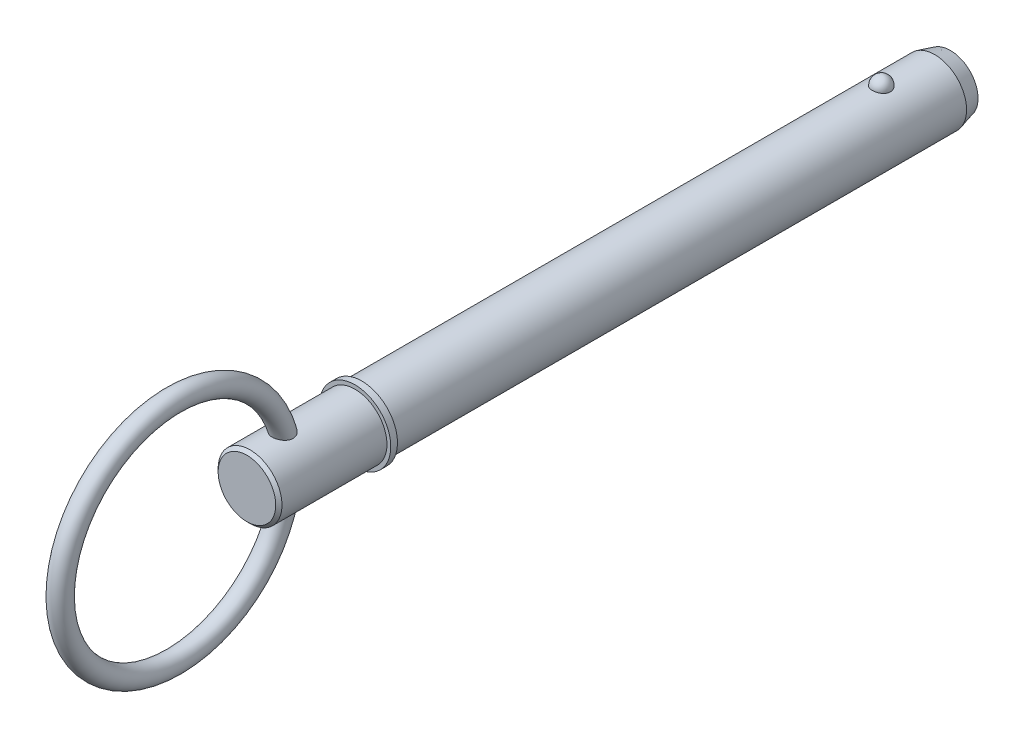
ISO-10303-21;
HEADER;
FILE_DESCRIPTION(('STEP AP214'),'2;1');
FILE_NAME('part.step','',(''),(''),'','','');
FILE_SCHEMA(('AUTOMOTIVE_DESIGN { 1 0 10303 214 1 1 1 1 }'));
ENDSEC;
DATA;
#1=APPLICATION_CONTEXT('core data for automotive mechanical design processes');
#2=APPLICATION_PROTOCOL_DEFINITION('international standard','automotive_design',2000,#1);
#3=PRODUCT_CONTEXT('',#1,'mechanical');
#4=PRODUCT('Part','Part','',(#3));
#5=PRODUCT_RELATED_PRODUCT_CATEGORY('part','',(#4));
#6=PRODUCT_DEFINITION_FORMATION('','',#4);
#7=PRODUCT_DEFINITION_CONTEXT('part definition',#1,'design');
#8=PRODUCT_DEFINITION('design','',#6,#7);
#9=PRODUCT_DEFINITION_SHAPE('','',#8);
#10=(LENGTH_UNIT() NAMED_UNIT(*) SI_UNIT(.MILLI.,.METRE.));
#11=(NAMED_UNIT(*) PLANE_ANGLE_UNIT() SI_UNIT($,.RADIAN.));
#12=(NAMED_UNIT(*) SI_UNIT($,.STERADIAN.) SOLID_ANGLE_UNIT());
#13=UNCERTAINTY_MEASURE_WITH_UNIT(LENGTH_MEASURE(1.E-05),#10,'distance_accuracy_value','');
#14=(GEOMETRIC_REPRESENTATION_CONTEXT(3) GLOBAL_UNCERTAINTY_ASSIGNED_CONTEXT((#13)) GLOBAL_UNIT_ASSIGNED_CONTEXT((#10,
#11,#12)) REPRESENTATION_CONTEXT('',''));
#15=CARTESIAN_POINT('',(0.,0.,0.));
#16=DIRECTION('',(0.,0.,1.));
#17=DIRECTION('',(1.,0.,0.));
#18=AXIS2_PLACEMENT_3D('',#15,#16,#17);
#19=CARTESIAN_POINT('',(0.,0.,114.3));
#20=DIRECTION('',(0.,0.,-1.));
#21=DIRECTION('',(-1.,0.,0.));
#22=AXIS2_PLACEMENT_3D('',#19,#20,#21);
#23=CYLINDRICAL_SURFACE('',#22,7.145);
#24=CARTESIAN_POINT('',(1.99971637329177,6.85945766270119,-2.02));
#25=CARTESIAN_POINT('',(1.9997145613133,6.85945924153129,-1.9070973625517));
#26=CARTESIAN_POINT('',(1.99051486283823,6.86216053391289,-1.79417185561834));
#27=CARTESIAN_POINT('',(1.95393597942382,6.87266409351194,-1.57152267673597));
#28=CARTESIAN_POINT('',(1.92655029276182,6.88046818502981,-1.46180016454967));
#29=CARTESIAN_POINT('',(1.85429435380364,6.90029063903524,-1.24873107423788));
#30=CARTESIAN_POINT('',(1.80943177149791,6.91230715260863,-1.14538172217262));
#31=CARTESIAN_POINT('',(1.70333474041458,6.93921158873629,-0.947875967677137));
#32=CARTESIAN_POINT('',(1.64210059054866,6.95409945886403,-0.853719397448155));
#33=CARTESIAN_POINT('',(1.5044381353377,6.98517577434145,-0.676721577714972));
#34=CARTESIAN_POINT('',(1.42793505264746,7.00137037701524,-0.593939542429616));
#35=CARTESIAN_POINT('',(1.26189697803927,7.03319066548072,-0.442536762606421));
#36=CARTESIAN_POINT('',(1.17236198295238,7.04881635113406,-0.373916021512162));
#37=CARTESIAN_POINT('',(0.982932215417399,7.0777121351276,-0.252935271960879));
#38=CARTESIAN_POINT('',(0.883068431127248,7.09098897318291,-0.200528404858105));
#39=CARTESIAN_POINT('',(0.675560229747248,7.11375589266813,-0.113212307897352));
#40=CARTESIAN_POINT('',(0.567916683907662,7.12324639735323,-0.0783011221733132));
#41=CARTESIAN_POINT('',(0.350006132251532,7.13724173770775,-0.0274707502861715));
#42=CARTESIAN_POINT('',(0.239822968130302,7.14183447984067,-0.0112162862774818));
#43=CARTESIAN_POINT('',(0.0181946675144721,7.14583597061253,0.00296794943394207));
#44=CARTESIAN_POINT('',(-0.0932503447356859,7.14524522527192,0.000899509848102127));
#45=CARTESIAN_POINT('',(-0.312527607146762,7.13899247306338,-0.0213331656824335));
#46=CARTESIAN_POINT('',(-0.420388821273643,7.13340426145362,-0.0412340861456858));
#47=CARTESIAN_POINT('',(-0.631141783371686,7.11785474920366,-0.0982040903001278));
#48=CARTESIAN_POINT('',(-0.734033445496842,7.10789337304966,-0.135273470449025));
#49=CARTESIAN_POINT('',(-0.932634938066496,7.08458058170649,-0.225826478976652));
#50=CARTESIAN_POINT('',(-1.02829911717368,7.07120963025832,-0.27940508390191));
#51=CARTESIAN_POINT('',(-1.20927180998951,7.04252043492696,-0.401457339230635));
#52=CARTESIAN_POINT('',(-1.29457925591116,7.02720199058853,-0.469932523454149));
#53=CARTESIAN_POINT('',(-1.45423311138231,6.995926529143,-0.621438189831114));
#54=CARTESIAN_POINT('',(-1.5283348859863,6.97996288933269,-0.7047251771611));
#55=CARTESIAN_POINT('',(-1.66169281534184,6.94942414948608,-0.882667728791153));
#56=CARTESIAN_POINT('',(-1.72094789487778,6.93484915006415,-0.977324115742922));
#57=CARTESIAN_POINT('',(-1.82375276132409,6.90853186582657,-1.17661373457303));
#58=CARTESIAN_POINT('',(-1.86711024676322,6.8968248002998,-1.28135093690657));
#59=CARTESIAN_POINT('',(-1.9360425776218,6.87779420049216,-1.49689986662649));
#60=CARTESIAN_POINT('',(-1.96161794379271,6.87047053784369,-1.60771141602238));
#61=CARTESIAN_POINT('',(-1.99427437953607,6.86106309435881,-1.83176258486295));
#62=CARTESIAN_POINT('',(-2.00143373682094,6.8589571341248,-1.9449898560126));
#63=CARTESIAN_POINT('',(-1.99730449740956,6.86016064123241,-2.17107603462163));
#64=CARTESIAN_POINT('',(-1.98601641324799,6.86346995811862,-2.28393495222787));
#65=CARTESIAN_POINT('',(-1.94538181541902,6.87509649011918,-2.5054843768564));
#66=CARTESIAN_POINT('',(-1.91612773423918,6.88338806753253,-2.61419321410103));
#67=CARTESIAN_POINT('',(-1.84036449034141,6.90402888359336,-2.82501243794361));
#68=CARTESIAN_POINT('',(-1.79385462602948,6.91637828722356,-2.92712255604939));
#69=CARTESIAN_POINT('',(-1.68442067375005,6.94384180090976,-3.12247704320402));
#70=CARTESIAN_POINT('',(-1.62140729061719,6.95897081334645,-3.21566929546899));
#71=CARTESIAN_POINT('',(-1.4806650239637,6.99026742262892,-3.38999412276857));
#72=CARTESIAN_POINT('',(-1.40293556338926,7.00643506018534,-3.47112622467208));
#73=CARTESIAN_POINT('',(-1.2344320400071,7.03807960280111,-3.61938672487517));
#74=CARTESIAN_POINT('',(-1.1436092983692,7.05355363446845,-3.68646046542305));
#75=CARTESIAN_POINT('',(-0.9515914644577,7.08201263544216,-3.80431973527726));
#76=CARTESIAN_POINT('',(-0.850397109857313,7.09499778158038,-3.85510642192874));
#77=CARTESIAN_POINT('',(-0.641823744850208,7.11687679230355,-3.93839532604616));
#78=CARTESIAN_POINT('',(-0.534539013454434,7.1258202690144,-3.9711204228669));
#79=CARTESIAN_POINT('',(-0.315743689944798,7.1388605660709,-4.01830716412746));
#80=CARTESIAN_POINT('',(-0.204233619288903,7.14295798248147,-4.03277105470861));
#81=CARTESIAN_POINT('',(0.0175518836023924,7.14582273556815,-4.04291389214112));
#82=CARTESIAN_POINT('',(0.127809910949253,7.14469090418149,-4.03894819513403));
#83=CARTESIAN_POINT('',(0.346044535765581,7.13745046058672,-4.01315850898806));
#84=CARTESIAN_POINT('',(0.454021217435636,7.13134203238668,-3.99133518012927));
#85=CARTESIAN_POINT('',(0.664227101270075,7.11483713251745,-3.93057164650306));
#86=CARTESIAN_POINT('',(0.766477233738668,7.10445761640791,-3.89169908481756));
#87=CARTESIAN_POINT('',(0.962929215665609,7.08050813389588,-3.79792023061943));
#88=CARTESIAN_POINT('',(1.05713054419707,7.06693796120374,-3.7430129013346));
#89=CARTESIAN_POINT('',(1.23644031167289,7.03780007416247,-3.61765173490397));
#90=CARTESIAN_POINT('',(1.32138387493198,7.0222044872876,-3.54696861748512));
#91=CARTESIAN_POINT('',(1.47830582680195,6.99085504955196,-3.39245228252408));
#92=CARTESIAN_POINT('',(1.55028198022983,6.97510117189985,-3.30861680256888));
#93=CARTESIAN_POINT('',(1.68063701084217,6.94485803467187,-3.12843058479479));
#94=CARTESIAN_POINT('',(1.73875175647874,6.93039619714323,-3.03188405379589));
#95=CARTESIAN_POINT('',(1.83823393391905,6.90467783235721,-2.83015210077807));
#96=CARTESIAN_POINT('',(1.87960712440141,6.89342020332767,-2.72496966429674));
#97=CARTESIAN_POINT('',(1.94111647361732,6.87633596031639,-2.52050234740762));
#98=CARTESIAN_POINT('',(1.96305249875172,6.87005682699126,-2.42179225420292));
#99=CARTESIAN_POINT('',(1.99235308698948,6.86161702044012,-2.22206084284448));
#100=CARTESIAN_POINT('',(1.99971799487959,6.85945624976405,-2.12103957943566));
#101=CARTESIAN_POINT('',(1.99971637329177,6.85945766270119,-2.02));
#102=B_SPLINE_CURVE_WITH_KNOTS('',3,(#24,#25,#26,#27,#28,#29,#30,#31,#32,#33,#34,#35,#36,#37,
#38,#39,#40,#41,#42,#43,#44,#45,#46,#47,#48,#49,#50,#51,#52,#53,#54,#55,#56,#57,#58,#59,#60,#61,
#62,#63,#64,#65,#66,#67,#68,#69,#70,#71,#72,#73,#74,#75,#76,#77,#78,#79,#80,#81,#82,#83,#84,#85,
#86,#87,#88,#89,#90,#91,#92,#93,#94,#95,#96,#97,#98,#99,#100,#101),.UNSPECIFIED.,.T.,.F.,(4,2,2,
2,2,2,2,2,2,2,2,2,2,2,2,2,2,2,2,2,2,2,2,2,2,2,2,2,2,2,2,2,2,2,2,2,2,2,4),(0.,0.338345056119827,
0.676811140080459,1.01512885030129,1.35344038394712,1.69345130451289,2.03346230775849,
2.37248128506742,2.71146235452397,3.04425125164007,3.37700766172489,3.70493009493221,
4.03285819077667,4.36270921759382,4.69259422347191,5.02887632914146,5.36518278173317,
5.70543263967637,6.04567253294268,6.38446363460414,6.72324532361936,7.06029846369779,
7.39736530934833,7.73629500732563,8.07523799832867,8.41547528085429,8.7556883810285,
9.09160363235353,9.42747756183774,9.75690239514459,10.0863150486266,10.4144324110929,
10.7425709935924,11.0758313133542,11.4091490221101,11.748385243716,12.0875046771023,
12.3903058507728,12.6930998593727),.UNSPECIFIED.);
#103=CARTESIAN_POINT('',(1.99971637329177,6.85945766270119,-2.02));
#104=VERTEX_POINT('',#103);
#105=EDGE_CURVE('E103',#104,#104,#102,.T.);
#106=ORIENTED_EDGE('',*,*,#105,.T.);
#107=EDGE_LOOP('',(#106));
#108=FACE_BOUND('',#107,.T.);
#109=CARTESIAN_POINT('',(0.,0.,-13.9499999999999));
#110=DIRECTION('',(0.,0.,-1.));
#111=DIRECTION('',(-1.,0.,0.));
#112=AXIS2_PLACEMENT_3D('',#109,#110,#111);
#113=CIRCLE('',#112,7.145);
#114=CARTESIAN_POINT('',(-7.145,0.,-13.9499999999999));
#115=VERTEX_POINT('',#114);
#116=EDGE_CURVE('E110',#115,#115,#113,.F.);
#117=ORIENTED_EDGE('',*,*,#116,.T.);
#118=EDGE_LOOP('',(#117));
#119=FACE_BOUND('',#118,.T.);
#120=CARTESIAN_POINT('',(0.,0.,114.3));
#121=DIRECTION('',(0.,0.,1.));
#122=DIRECTION('',(1.,0.,0.));
#123=AXIS2_PLACEMENT_3D('',#120,#121,#122);
#124=CIRCLE('',#123,7.145);
#125=CARTESIAN_POINT('',(7.145,0.,114.3));
#126=VERTEX_POINT('',#125);
#127=EDGE_CURVE('E108',#126,#126,#124,.T.);
#128=ORIENTED_EDGE('',*,*,#127,.F.);
#129=EDGE_LOOP('',(#128));
#130=FACE_BOUND('',#129,.T.);
#131=ADVANCED_FACE('F39',(#108,#119,#130),#23,.T.);
#132=CARTESIAN_POINT('',(0.,0.,-17.45));
#133=DIRECTION('',(0.,0.,-1.));
#134=DIRECTION('',(-1.,0.,0.));
#135=AXIS2_PLACEMENT_3D('',#132,#133,#134);
#136=PLANE('',#135);
#137=CARTESIAN_POINT('',(0.,0.,-17.45));
#138=DIRECTION('',(0.,0.,-1.));
#139=DIRECTION('',(-1.,0.,0.));
#140=AXIS2_PLACEMENT_3D('',#137,#138,#139);
#141=CIRCLE('',#140,6.20717782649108);
#142=CARTESIAN_POINT('',(-6.20717782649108,0.,-17.45));
#143=VERTEX_POINT('',#142);
#144=EDGE_CURVE('E143',#143,#143,#141,.T.);
#145=ORIENTED_EDGE('',*,*,#144,.T.);
#146=EDGE_LOOP('',(#145));
#147=FACE_BOUND('',#146,.T.);
#148=ADVANCED_FACE('F89',(#147),#136,.T.);
#149=CARTESIAN_POINT('',(0.,0.,-17.45));
#150=DIRECTION('',(0.,0.,1.));
#151=DIRECTION('',(1.,0.,0.));
#152=AXIS2_PLACEMENT_3D('',#149,#150,#151);
#153=CONICAL_SURFACE('',#152,6.20717782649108,0.261799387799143);
#154=ORIENTED_EDGE('',*,*,#116,.F.);
#155=EDGE_LOOP('',(#154));
#156=FACE_BOUND('',#155,.T.);
#157=ORIENTED_EDGE('',*,*,#144,.F.);
#158=EDGE_LOOP('',(#157));
#159=FACE_BOUND('',#158,.T.);
#160=ADVANCED_FACE('F95',(#156,#159),#153,.T.);
#161=CARTESIAN_POINT('',(0.,7.145,-2.02));
#162=DIRECTION('',(0.,1.,0.));
#163=DIRECTION('',(0.,0.,-1.));
#164=AXIS2_PLACEMENT_3D('',#161,#162,#163);
#165=SPHERICAL_SURFACE('',#164,2.02);
#166=ORIENTED_EDGE('',*,*,#105,.F.);
#167=EDGE_LOOP('',(#166));
#168=FACE_BOUND('',#167,.T.);
#169=ADVANCED_FACE('F113',(#168),#165,.T.);
#170=CARTESIAN_POINT('',(0.,0.,114.3));
#171=DIRECTION('',(0.,0.,-1.));
#172=DIRECTION('',(-1.,0.,0.));
#173=AXIS2_PLACEMENT_3D('',#170,#171,#172);
#174=PLANE('',#173);
#175=ORIENTED_EDGE('',*,*,#127,.T.);
#176=EDGE_LOOP('',(#175));
#177=FACE_BOUND('',#176,.T.);
#178=CARTESIAN_POINT('',(0.,0.,114.3));
#179=DIRECTION('',(0.,0.,-1.));
#180=DIRECTION('',(-1.,0.,0.));
#181=AXIS2_PLACEMENT_3D('',#178,#179,#180);
#182=CIRCLE('',#181,8.);
#183=CARTESIAN_POINT('',(-8.,0.,114.3));
#184=VERTEX_POINT('',#183);
#185=EDGE_CURVE('E109',#184,#184,#182,.T.);
#186=ORIENTED_EDGE('',*,*,#185,.T.);
#187=EDGE_LOOP('',(#186));
#188=FACE_BOUND('',#187,.T.);
#189=ADVANCED_FACE('F117',(#177,#188),#174,.T.);
#190=CARTESIAN_POINT('',(0.,0.,33.7287874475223));
#191=DIRECTION('',(0.,0.,-1.));
#192=DIRECTION('',(-1.,0.,0.));
#193=AXIS2_PLACEMENT_3D('',#190,#191,#192);
#194=CYLINDRICAL_SURFACE('',#193,8.);
#195=CARTESIAN_POINT('',(0.,0.,115.8));
#196=DIRECTION('',(0.,0.,-1.));
#197=DIRECTION('',(-1.,0.,0.));
#198=AXIS2_PLACEMENT_3D('',#195,#196,#197);
#199=CIRCLE('',#198,8.);
#200=CARTESIAN_POINT('',(-8.,0.,115.8));
#201=VERTEX_POINT('',#200);
#202=EDGE_CURVE('E134',#201,#201,#199,.T.);
#203=ORIENTED_EDGE('',*,*,#202,.T.);
#204=EDGE_LOOP('',(#203));
#205=FACE_BOUND('',#204,.T.);
#206=ORIENTED_EDGE('',*,*,#185,.F.);
#207=EDGE_LOOP('',(#206));
#208=FACE_BOUND('',#207,.T.);
#209=ADVANCED_FACE('F121',(#205,#208),#194,.T.);
#210=CARTESIAN_POINT('',(0.,8.,115.8));
#211=DIRECTION('',(0.,0.,1.));
#212=DIRECTION('',(1.,0.,0.));
#213=AXIS2_PLACEMENT_3D('',#210,#211,#212);
#214=PLANE('',#213);
#215=CARTESIAN_POINT('',(0.,0.,115.8));
#216=DIRECTION('',(0.,0.,1.));
#217=DIRECTION('',(1.,0.,0.));
#218=AXIS2_PLACEMENT_3D('',#215,#216,#217);
#219=CIRCLE('',#218,7.145);
#220=CARTESIAN_POINT('',(7.145,0.,115.8));
#221=VERTEX_POINT('',#220);
#222=EDGE_CURVE('E112',#221,#221,#219,.T.);
#223=ORIENTED_EDGE('',*,*,#222,.F.);
#224=EDGE_LOOP('',(#223));
#225=FACE_BOUND('',#224,.T.);
#226=ORIENTED_EDGE('',*,*,#202,.F.);
#227=EDGE_LOOP('',(#226));
#228=FACE_BOUND('',#227,.T.);
#229=ADVANCED_FACE('F86',(#225,#228),#214,.T.);
#230=CARTESIAN_POINT('',(0.,0.,140.));
#231=DIRECTION('',(0.,0.,-1.));
#232=DIRECTION('',(-1.,0.,0.));
#233=AXIS2_PLACEMENT_3D('',#230,#231,#232);
#234=CYLINDRICAL_SURFACE('',#233,7.145);
#235=CARTESIAN_POINT('',(-1.03551034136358,-7.0695645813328,129.930259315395));
#236=CARTESIAN_POINT('',(-0.923225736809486,-7.08601142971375,129.874402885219));
#237=CARTESIAN_POINT('',(-0.806039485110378,-7.10042113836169,129.827835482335));
#238=CARTESIAN_POINT('',(-0.565173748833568,-7.1236385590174,129.754279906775));
#239=CARTESIAN_POINT('',(-0.441495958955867,-7.13244772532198,129.727286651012));
#240=CARTESIAN_POINT('',(-0.191106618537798,-7.14354309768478,129.693450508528));
#241=CARTESIAN_POINT('',(-0.0643945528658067,-7.14582818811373,129.686611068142));
#242=CARTESIAN_POINT('',(0.18844338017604,-7.14363337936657,129.693241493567));
#243=CARTESIAN_POINT('',(0.314569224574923,-7.13915321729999,129.706712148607));
#244=CARTESIAN_POINT('',(0.562499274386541,-7.12390574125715,129.75364165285));
#245=CARTESIAN_POINT('',(0.684308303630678,-7.11314569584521,129.787077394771));
#246=CARTESIAN_POINT('',(0.920329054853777,-7.08647538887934,129.873194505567));
#247=CARTESIAN_POINT('',(1.03454038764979,-7.07056486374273,129.925876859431));
#248=CARTESIAN_POINT('',(1.2523263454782,-7.03526161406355,130.0494470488));
#249=CARTESIAN_POINT('',(1.35588248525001,-7.01586299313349,130.12036580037));
#250=CARTESIAN_POINT('',(1.54916093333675,-6.9757352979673,130.278757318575));
#251=CARTESIAN_POINT('',(1.63888414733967,-6.95500631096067,130.366229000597));
#252=CARTESIAN_POINT('',(1.80113983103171,-6.91475703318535,130.554727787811));
#253=CARTESIAN_POINT('',(1.87381924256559,-6.89522757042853,130.655626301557));
#254=CARTESIAN_POINT('',(2.00091178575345,-6.8594283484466,130.86884010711));
#255=CARTESIAN_POINT('',(2.05532963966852,-6.8431577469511,130.981152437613));
#256=CARTESIAN_POINT('',(2.14350100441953,-6.81604873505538,131.211194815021));
#257=CARTESIAN_POINT('',(2.17770329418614,-6.80509340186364,131.328739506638));
#258=CARTESIAN_POINT('',(2.22691394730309,-6.7891497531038,131.568149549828));
#259=CARTESIAN_POINT('',(2.2419216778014,-6.7841616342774,131.690015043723));
#260=CARTESIAN_POINT('',(2.25313992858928,-6.78044381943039,131.93580699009));
#261=CARTESIAN_POINT('',(2.24917302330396,-6.78177319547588,132.059742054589));
#262=CARTESIAN_POINT('',(2.22301329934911,-6.79039131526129,132.305438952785));
#263=CARTESIAN_POINT('',(2.20081491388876,-6.79768187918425,132.4272001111));
#264=CARTESIAN_POINT('',(2.13702421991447,-6.81801706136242,132.675287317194));
#265=CARTESIAN_POINT('',(2.09404815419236,-6.83146790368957,132.801223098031));
#266=CARTESIAN_POINT('',(1.98986384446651,-6.86253672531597,133.044824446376));
#267=CARTESIAN_POINT('',(1.92864130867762,-6.88015796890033,133.162483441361));
#268=CARTESIAN_POINT('',(1.7827436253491,-6.91947130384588,133.397497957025));
#269=CARTESIAN_POINT('',(1.6964070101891,-6.94139021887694,133.513789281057));
#270=CARTESIAN_POINT('',(1.50503944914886,-6.98537683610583,133.729799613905));
#271=CARTESIAN_POINT('',(1.40001969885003,-7.00744444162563,133.829528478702));
#272=CARTESIAN_POINT('',(1.19221781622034,-7.04548349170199,133.993170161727));
#273=CARTESIAN_POINT('',(1.09203347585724,-7.06185586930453,134.06028599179));
#274=CARTESIAN_POINT('',(0.88160718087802,-7.09119477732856,134.177337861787));
#275=CARTESIAN_POINT('',(0.771372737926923,-7.10416382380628,134.227286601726));
#276=CARTESIAN_POINT('',(0.542622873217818,-7.12529560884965,134.307475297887));
#277=CARTESIAN_POINT('',(0.424058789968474,-7.13342692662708,134.33758654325));
#278=CARTESIAN_POINT('',(0.183155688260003,-7.14366628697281,134.375370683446));
#279=CARTESIAN_POINT('',(0.0608191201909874,-7.14577815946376,134.383057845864));
#280=CARTESIAN_POINT('',(-0.169367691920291,-7.14381572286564,134.375860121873));
#281=CARTESIAN_POINT('',(-0.277308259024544,-7.14040669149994,134.363402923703));
#282=CARTESIAN_POINT('',(-0.489468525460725,-7.12900651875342,134.321156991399));
#283=CARTESIAN_POINT('',(-0.593687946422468,-7.12101503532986,134.291366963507));
#284=CARTESIAN_POINT('',(-0.796149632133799,-7.10123695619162,134.215987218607));
#285=CARTESIAN_POINT('',(-0.894373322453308,-7.08943921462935,134.170351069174));
#286=CARTESIAN_POINT('',(-1.08274371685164,-7.06312621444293,134.065336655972));
#287=CARTESIAN_POINT('',(-1.17288754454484,-7.04860999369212,134.005953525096));
#288=CARTESIAN_POINT('',(-1.35484961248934,-7.01605385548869,133.867113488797));
#289=CARTESIAN_POINT('',(-1.44541008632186,-6.99780069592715,133.786061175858));
#290=CARTESIAN_POINT('',(-1.61364655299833,-6.96093393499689,133.611599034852));
#291=CARTESIAN_POINT('',(-1.69131381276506,-6.94232009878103,133.518180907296));
#292=CARTESIAN_POINT('',(-1.84330074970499,-6.90364386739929,133.306608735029));
#293=CARTESIAN_POINT('',(-1.91543090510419,-6.88377370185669,133.186839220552));
#294=CARTESIAN_POINT('',(-2.04002946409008,-6.84788436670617,132.936875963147));
#295=CARTESIAN_POINT('',(-2.09248830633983,-6.83186707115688,132.806677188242));
#296=CARTESIAN_POINT('',(-2.17795964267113,-6.80511869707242,132.532555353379));
#297=CARTESIAN_POINT('',(-2.20992909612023,-6.79467512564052,132.388274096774));
#298=CARTESIAN_POINT('',(-2.24813111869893,-6.78213595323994,132.095984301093));
#299=CARTESIAN_POINT('',(-2.25438316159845,-6.78003403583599,131.947978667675));
#300=CARTESIAN_POINT('',(-2.24011368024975,-6.78475868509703,131.665430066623));
#301=CARTESIAN_POINT('',(-2.22172362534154,-6.79087455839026,131.530769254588));
#302=CARTESIAN_POINT('',(-2.16145328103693,-6.81029672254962,131.267367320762));
#303=CARTESIAN_POINT('',(-2.11958615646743,-6.82359898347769,131.138622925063));
#304=CARTESIAN_POINT('',(-2.01784121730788,-6.85433303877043,130.902267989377));
#305=CARTESIAN_POINT('',(-1.9598239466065,-6.8713108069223,130.793792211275));
#306=CARTESIAN_POINT('',(-1.82642155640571,-6.90796511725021,130.588591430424));
#307=CARTESIAN_POINT('',(-1.75103235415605,-6.92764229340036,130.491869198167));
#308=CARTESIAN_POINT('',(-1.57825515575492,-6.96911949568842,130.305408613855));
#309=CARTESIAN_POINT('',(-1.47957996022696,-6.9909623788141,130.21687037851));
#310=CARTESIAN_POINT('',(-1.26760341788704,-7.0324852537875,130.058840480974));
#311=CARTESIAN_POINT('',(-1.15429989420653,-7.05216492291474,129.989351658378));
#312=CARTESIAN_POINT('',(-1.03551034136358,-7.0695645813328,129.930259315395));
#313=B_SPLINE_CURVE_WITH_KNOTS('',3,(#235,#236,#237,#238,#239,#240,#241,#242,#243,#244,#245,
#246,#247,#248,#249,#250,#251,#252,#253,#254,#255,#256,#257,#258,#259,#260,#261,#262,#263,#264,
#265,#266,#267,#268,#269,#270,#271,#272,#273,#274,#275,#276,#277,#278,#279,#280,#281,#282,#283,
#284,#285,#286,#287,#288,#289,#290,#291,#292,#293,#294,#295,#296,#297,#298,#299,#300,#301,#302,
#303,#304,#305,#306,#307,#308,#309,#310,#311,#312),.UNSPECIFIED.,.T.,.F.,(4,2,2,2,2,2,2,2,2,2,2,
2,2,2,2,2,2,2,2,2,2,2,2,2,2,2,2,2,2,2,2,2,2,2,2,2,2,2,4),(0.,0.378979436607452,
0.757860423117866,1.13680619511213,1.51576669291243,1.89428943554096,2.27283155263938,
2.65201969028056,3.03118299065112,3.40694616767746,3.78261210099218,4.14959041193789,
4.51658082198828,4.88700951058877,5.25755134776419,5.6571370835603,6.05703662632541,
6.49445595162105,6.93161403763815,7.29520224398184,7.65852089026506,8.02417421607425,
8.38959483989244,8.71415763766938,9.03874466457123,9.36429093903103,9.68995264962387,
10.0572255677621,10.4247462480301,10.8465602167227,11.2685789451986,11.7106604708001,
12.152407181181,12.5583067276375,12.9639788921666,13.3347314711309,13.7055712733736,
14.1064462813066,14.5073810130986),.UNSPECIFIED.);
#314=CARTESIAN_POINT('',(-1.03551034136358,-7.0695645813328,129.930259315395));
#315=VERTEX_POINT('',#314);
#316=EDGE_CURVE('E10',#315,#315,#313,.T.);
#317=ORIENTED_EDGE('',*,*,#316,.F.);
#318=EDGE_LOOP('',(#317));
#319=FACE_BOUND('',#318,.T.);
#320=CARTESIAN_POINT('',(-1.03551034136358,7.0695645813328,129.930259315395));
#321=CARTESIAN_POINT('',(-1.14644953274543,7.05331457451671,129.985446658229));
#322=CARTESIAN_POINT('',(-1.25260902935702,7.03507806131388,130.049702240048));
#323=CARTESIAN_POINT('',(-1.45240021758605,6.99656564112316,130.194958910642));
#324=CARTESIAN_POINT('',(-1.54602879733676,6.97628922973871,130.275964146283));
#325=CARTESIAN_POINT('',(-1.71815091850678,6.93590796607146,130.452910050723));
#326=CARTESIAN_POINT('',(-1.79663177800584,6.91580327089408,130.548863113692));
#327=CARTESIAN_POINT('',(-1.93607718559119,6.87807159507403,130.753162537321));
#328=CARTESIAN_POINT('',(-1.99704642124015,6.86044395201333,130.861505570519));
#329=CARTESIAN_POINT('',(-2.09894945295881,6.82995115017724,131.085542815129));
#330=CARTESIAN_POINT('',(-2.1402125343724,6.81700866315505,131.201076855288));
#331=CARTESIAN_POINT('',(-2.20347311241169,6.79682602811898,131.437758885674));
#332=CARTESIAN_POINT('',(-2.22547114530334,6.78958572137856,131.558906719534));
#333=CARTESIAN_POINT('',(-2.25026114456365,6.78140983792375,131.803214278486));
#334=CARTESIAN_POINT('',(-2.25306986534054,6.78046876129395,131.92637215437));
#335=CARTESIAN_POINT('',(-2.2403056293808,6.78469532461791,132.171604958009));
#336=CARTESIAN_POINT('',(-2.22472720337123,6.78986478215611,132.293679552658));
#337=CARTESIAN_POINT('',(-2.17472134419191,6.8060520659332,132.542036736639));
#338=CARTESIAN_POINT('',(-2.13910164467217,6.81743831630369,132.668053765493));
#339=CARTESIAN_POINT('',(-2.04975058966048,6.84483151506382,132.912973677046));
#340=CARTESIAN_POINT('',(-1.99600968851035,6.86084089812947,133.031872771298));
#341=CARTESIAN_POINT('',(-1.86558545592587,6.8975101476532,133.271425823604));
#342=CARTESIAN_POINT('',(-1.78715729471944,6.91847353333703,133.391087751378));
#343=CARTESIAN_POINT('',(-1.61149373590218,6.96148580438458,133.615646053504));
#344=CARTESIAN_POINT('',(-1.51424701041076,6.98353533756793,133.72053346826));
#345=CARTESIAN_POINT('',(-1.30107590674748,7.02639179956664,133.912951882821));
#346=CARTESIAN_POINT('',(-1.18492282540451,7.04717858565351,134.000236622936));
#347=CARTESIAN_POINT('',(-0.937392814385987,7.08434208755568,134.150827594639));
#348=CARTESIAN_POINT('',(-0.806039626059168,7.10072555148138,134.214170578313));
#349=CARTESIAN_POINT('',(-0.550470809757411,7.12475629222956,134.305483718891));
#350=CARTESIAN_POINT('',(-0.427643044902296,7.13327781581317,134.337047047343));
#351=CARTESIAN_POINT('',(-0.240556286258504,7.14122488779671,134.366356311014));
#352=CARTESIAN_POINT('',(-0.177714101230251,7.14306799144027,134.373119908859));
#353=CARTESIAN_POINT('',(-0.0516470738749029,7.14509121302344,134.380539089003));
#354=CARTESIAN_POINT('',(0.0115777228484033,7.14527152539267,134.381195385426));
#355=CARTESIAN_POINT('',(0.182932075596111,7.14347436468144,134.374616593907));
#356=CARTESIAN_POINT('',(0.290871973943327,7.13986325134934,134.361408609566));
#357=CARTESIAN_POINT('',(0.502842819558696,7.1280769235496,134.317690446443));
#358=CARTESIAN_POINT('',(0.606873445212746,7.11990133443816,134.287178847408));
#359=CARTESIAN_POINT('',(0.809001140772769,7.09978218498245,134.210378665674));
#360=CARTESIAN_POINT('',(0.907071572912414,7.08782300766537,134.164024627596));
#361=CARTESIAN_POINT('',(1.09503957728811,7.0612282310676,134.057620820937));
#362=CARTESIAN_POINT('',(1.18493426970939,7.04659169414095,133.997566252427));
#363=CARTESIAN_POINT('',(1.36644041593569,7.01380352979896,133.857233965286));
#364=CARTESIAN_POINT('',(1.45676563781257,6.99544216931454,133.775344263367));
#365=CARTESIAN_POINT('',(1.62440639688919,6.95842750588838,133.599231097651));
#366=CARTESIAN_POINT('',(1.701712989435,6.93977401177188,133.504999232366));
#367=CARTESIAN_POINT('',(1.85271606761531,6.90111647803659,133.291807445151));
#368=CARTESIAN_POINT('',(1.92421731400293,6.88131605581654,133.171248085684));
#369=CARTESIAN_POINT('',(2.04739198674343,6.84567995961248,132.919785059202));
#370=CARTESIAN_POINT('',(2.09905621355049,6.82984612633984,132.788876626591));
#371=CARTESIAN_POINT('',(2.18257767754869,6.80363167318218,132.513847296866));
#372=CARTESIAN_POINT('',(2.21345394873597,6.79352430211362,132.369397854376));
#373=CARTESIAN_POINT('',(2.24941288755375,6.78170753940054,132.076984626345));
#374=CARTESIAN_POINT('',(2.2545156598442,6.77999160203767,131.929023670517));
#375=CARTESIAN_POINT('',(2.2380435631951,6.78544298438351,131.647053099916));
#376=CARTESIAN_POINT('',(2.21864521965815,6.79188566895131,131.512903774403));
#377=CARTESIAN_POINT('',(2.1564876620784,6.81187529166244,131.250690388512));
#378=CARTESIAN_POINT('',(2.11373989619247,6.82541874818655,131.12262337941));
#379=CARTESIAN_POINT('',(2.01040099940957,6.85652522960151,130.887507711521));
#380=CARTESIAN_POINT('',(1.9516260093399,6.87365110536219,130.779597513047));
#381=CARTESIAN_POINT('',(1.81683142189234,6.91050025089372,130.575649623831));
#382=CARTESIAN_POINT('',(1.74081238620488,6.93022343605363,130.479611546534));
#383=CARTESIAN_POINT('',(1.574312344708,6.96992220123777,130.30254183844));
#384=CARTESIAN_POINT('',(1.48394688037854,6.98989467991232,130.221400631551));
#385=CARTESIAN_POINT('',(1.29081365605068,7.02812243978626,130.075038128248));
#386=CARTESIAN_POINT('',(1.18804491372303,7.04637758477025,130.009818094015));
#387=CARTESIAN_POINT('',(0.970386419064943,7.07967210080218,129.895377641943));
#388=CARTESIAN_POINT('',(0.855272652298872,7.09462807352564,129.846558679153));
#389=CARTESIAN_POINT('',(0.618143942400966,7.11920826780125,129.768071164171));
#390=CARTESIAN_POINT('',(0.49612834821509,7.12883198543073,129.738404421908));
#391=CARTESIAN_POINT('',(0.247581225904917,7.14180209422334,129.698698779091));
#392=CARTESIAN_POINT('',(0.121020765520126,7.14509609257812,129.688823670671));
#393=CARTESIAN_POINT('',(-0.132022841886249,7.14489967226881,129.689415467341));
#394=CARTESIAN_POINT('',(-0.258506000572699,7.14141109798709,129.699876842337));
#395=CARTESIAN_POINT('',(-0.496649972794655,7.12862600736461,129.739053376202));
#396=CARTESIAN_POINT('',(-0.608625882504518,7.11987587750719,129.766055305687));
#397=CARTESIAN_POINT('',(-0.826925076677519,7.09783467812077,129.836222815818));
#398=CARTESIAN_POINT('',(-0.933248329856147,7.08454358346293,129.879388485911));
#399=CARTESIAN_POINT('',(-1.03551034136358,7.0695645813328,129.930259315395));
#400=B_SPLINE_CURVE_WITH_KNOTS('',3,(#320,#321,#322,#323,#324,#325,#326,#327,#328,#329,#330,
#331,#332,#333,#334,#335,#336,#337,#338,#339,#340,#341,#342,#343,#344,#345,#346,#347,#348,#349,
#350,#351,#352,#353,#354,#355,#356,#357,#358,#359,#360,#361,#362,#363,#364,#365,#366,#367,#368,
#369,#370,#371,#372,#373,#374,#375,#376,#377,#378,#379,#380,#381,#382,#383,#384,#385,#386,#387,
#388,#389,#390,#391,#392,#393,#394,#395,#396,#397,#398,#399),.UNSPECIFIED.,.T.,.F.,(4,2,2,2,2,2,
2,2,2,2,2,2,2,2,2,2,2,2,2,2,2,2,2,2,2,2,2,2,2,2,2,2,2,2,2,2,2,2,2,4),(0.,0.374504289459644,
0.7491014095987,1.12401080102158,1.49881974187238,1.86712525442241,2.23542051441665,
2.60339417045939,2.97147730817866,3.36420696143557,3.75714381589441,4.18898920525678,
4.62109535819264,5.0588812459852,5.49599234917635,5.87475353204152,6.06416800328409,
6.25356032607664,6.57826179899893,6.90298992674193,7.22907626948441,7.55527703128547,
7.92373585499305,8.29244681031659,8.71527472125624,9.13829848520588,9.58009907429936,
10.0215549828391,10.4264139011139,10.831074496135,11.2014904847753,11.571894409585,
11.9394538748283,12.3070424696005,12.6830655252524,13.0591241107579,13.4382822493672,
13.8173372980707,14.1625475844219,14.5077597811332),.UNSPECIFIED.);
#401=CARTESIAN_POINT('',(-1.03551034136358,7.0695645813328,129.930259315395));
#402=VERTEX_POINT('',#401);
#403=EDGE_CURVE('E51',#402,#402,#400,.T.);
#404=ORIENTED_EDGE('',*,*,#403,.F.);
#405=EDGE_LOOP('',(#404));
#406=FACE_BOUND('',#405,.T.);
#407=CARTESIAN_POINT('',(0.,0.,139.3));
#408=DIRECTION('',(0.,0.,-1.));
#409=DIRECTION('',(-1.,0.,0.));
#410=AXIS2_PLACEMENT_3D('',#407,#408,#409);
#411=CIRCLE('',#410,7.145);
#412=CARTESIAN_POINT('',(-7.145,0.,139.3));
#413=VERTEX_POINT('',#412);
#414=EDGE_CURVE('E65',#413,#413,#411,.T.);
#415=ORIENTED_EDGE('',*,*,#414,.T.);
#416=EDGE_LOOP('',(#415));
#417=FACE_BOUND('',#416,.T.);
#418=ORIENTED_EDGE('',*,*,#222,.T.);
#419=EDGE_LOOP('',(#418));
#420=FACE_BOUND('',#419,.T.);
#421=ADVANCED_FACE('F70',(#319,#406,#417,#420),#234,.T.);
#422=CARTESIAN_POINT('',(0.,0.,140.));
#423=DIRECTION('',(0.,0.,-1.));
#424=DIRECTION('',(-1.,0.,0.));
#425=AXIS2_PLACEMENT_3D('',#422,#423,#424);
#426=PLANE('',#425);
#427=CARTESIAN_POINT('',(0.,0.,140.));
#428=DIRECTION('',(0.,0.,-1.));
#429=DIRECTION('',(-1.,0.,0.));
#430=AXIS2_PLACEMENT_3D('',#427,#428,#429);
#431=CIRCLE('',#430,6.44499999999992);
#432=CARTESIAN_POINT('',(-6.44499999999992,0.,140.));
#433=VERTEX_POINT('',#432);
#434=EDGE_CURVE('E58',#433,#433,#431,.F.);
#435=ORIENTED_EDGE('',*,*,#434,.T.);
#436=EDGE_LOOP('',(#435));
#437=FACE_BOUND('',#436,.T.);
#438=ADVANCED_FACE('F77',(#437),#426,.F.);
#439=CARTESIAN_POINT('',(0.,0.,139.3));
#440=DIRECTION('',(0.,0.,-1.));
#441=DIRECTION('',(-1.,0.,0.));
#442=AXIS2_PLACEMENT_3D('',#439,#440,#441);
#443=CONICAL_SURFACE('',#442,7.145,0.78539816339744);
#444=ORIENTED_EDGE('',*,*,#434,.F.);
#445=EDGE_LOOP('',(#444));
#446=FACE_BOUND('',#445,.T.);
#447=ORIENTED_EDGE('',*,*,#414,.F.);
#448=EDGE_LOOP('',(#447));
#449=FACE_BOUND('',#448,.T.);
#450=ADVANCED_FACE('F41',(#446,#449),#443,.T.);
#451=CARTESIAN_POINT('',(0.,0.,156.4));
#452=DIRECTION('',(1.,0.,0.));
#453=DIRECTION('',(0.,0.,-1.));
#454=AXIS2_PLACEMENT_3D('',#451,#452,#453);
#455=TOROIDAL_SURFACE('',#454,25.4,2.25);
#456=ORIENTED_EDGE('',*,*,#316,.T.);
#457=EDGE_LOOP('',(#456));
#458=FACE_BOUND('',#457,.T.);
#459=ORIENTED_EDGE('',*,*,#403,.T.);
#460=EDGE_LOOP('',(#459));
#461=FACE_BOUND('',#460,.T.);
#462=ADVANCED_FACE('F74',(#458,#461),#455,.T.);
#463=CLOSED_SHELL('',(#131,#148,#160,#169,#189,#209,#229,#421,#438,#450,#462));
#464=MANIFOLD_SOLID_BREP('B2',#463);
#465=ADVANCED_BREP_SHAPE_REPRESENTATION('',(#18,#464),#14);
#466=SHAPE_DEFINITION_REPRESENTATION(#9,#465);
ENDSEC;
END-ISO-10303-21;
